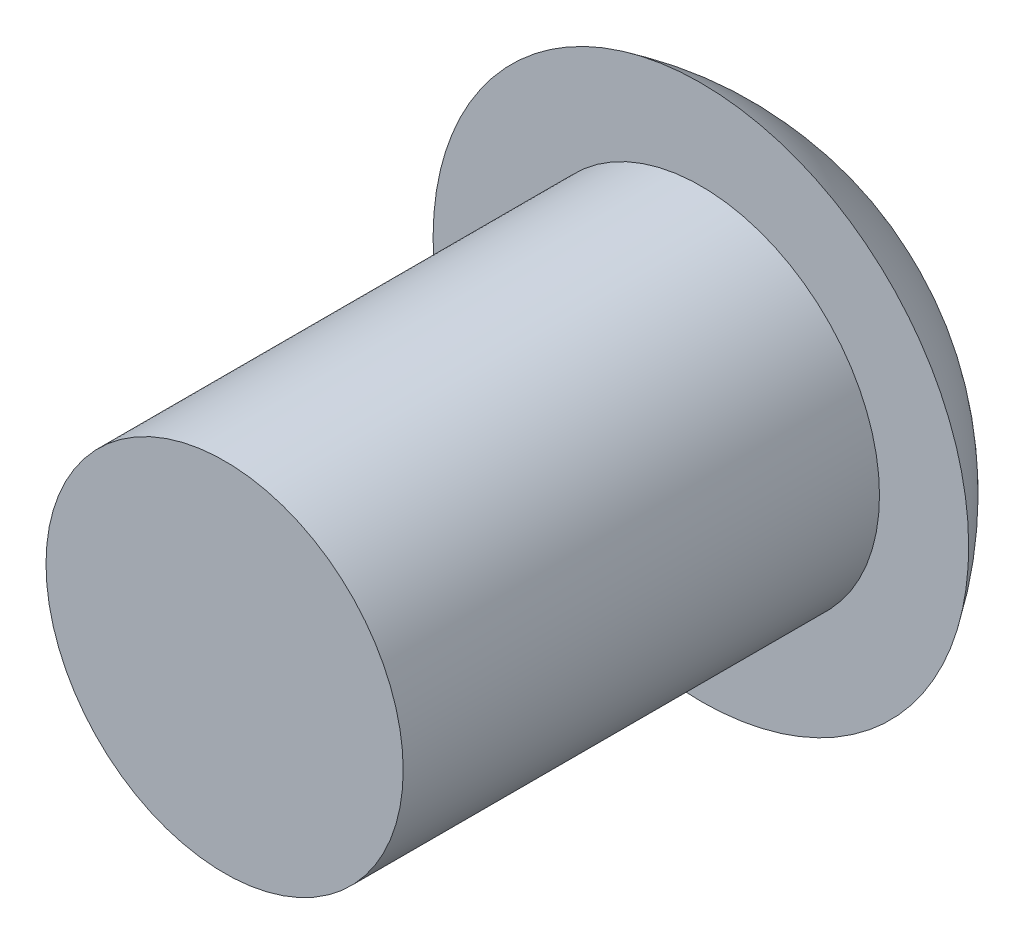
ISO-10303-21;
HEADER;
FILE_DESCRIPTION(('STEP AP214'),'2;1');
FILE_NAME('part.step','',(''),(''),'','','');
FILE_SCHEMA(('AUTOMOTIVE_DESIGN { 1 0 10303 214 1 1 1 1 }'));
ENDSEC;
DATA;
#1=APPLICATION_CONTEXT('core data for automotive mechanical design processes');
#2=APPLICATION_PROTOCOL_DEFINITION('international standard','automotive_design',2000,#1);
#3=PRODUCT_CONTEXT('',#1,'mechanical');
#4=PRODUCT('Part','Part','',(#3));
#5=PRODUCT_RELATED_PRODUCT_CATEGORY('part','',(#4));
#6=PRODUCT_DEFINITION_FORMATION('','',#4);
#7=PRODUCT_DEFINITION_CONTEXT('part definition',#1,'design');
#8=PRODUCT_DEFINITION('design','',#6,#7);
#9=PRODUCT_DEFINITION_SHAPE('','',#8);
#10=(LENGTH_UNIT() NAMED_UNIT(*) SI_UNIT(.MILLI.,.METRE.));
#11=(NAMED_UNIT(*) PLANE_ANGLE_UNIT() SI_UNIT($,.RADIAN.));
#12=(NAMED_UNIT(*) SI_UNIT($,.STERADIAN.) SOLID_ANGLE_UNIT());
#13=UNCERTAINTY_MEASURE_WITH_UNIT(LENGTH_MEASURE(1.E-05),#10,'distance_accuracy_value','');
#14=(GEOMETRIC_REPRESENTATION_CONTEXT(3) GLOBAL_UNCERTAINTY_ASSIGNED_CONTEXT((#13)) GLOBAL_UNIT_ASSIGNED_CONTEXT((#10,
#11,#12)) REPRESENTATION_CONTEXT('',''));
#15=CARTESIAN_POINT('',(0.,0.,0.));
#16=DIRECTION('',(0.,0.,1.));
#17=DIRECTION('',(1.,0.,0.));
#18=AXIS2_PLACEMENT_3D('',#15,#16,#17);
#19=CARTESIAN_POINT('',(-4.064,46.0375,2.44475));
#20=DIRECTION('',(0.,0.,1.));
#21=DIRECTION('',(1.,0.,0.));
#22=AXIS2_PLACEMENT_3D('',#19,#20,#21);
#23=PLANE('',#22);
#24=CARTESIAN_POINT('',(-4.064,46.0375,2.44475));
#25=DIRECTION('',(0.,0.,1.));
#26=DIRECTION('',(1.,0.,0.));
#27=AXIS2_PLACEMENT_3D('',#24,#25,#26);
#28=CIRCLE('',#27,1.190625);
#29=CARTESIAN_POINT('',(-2.873375,46.0375,2.44475));
#30=VERTEX_POINT('',#29);
#31=EDGE_CURVE('E21',#30,#30,#28,.F.);
#32=ORIENTED_EDGE('',*,*,#31,.F.);
#33=EDGE_LOOP('',(#32));
#34=FACE_BOUND('',#33,.T.);
#35=ADVANCED_FACE('F15',(#34),#23,.T.);
#36=CARTESIAN_POINT('',(-4.064,46.0375,-0.73025));
#37=DIRECTION('',(0.,0.,1.));
#38=DIRECTION('',(1.,0.,0.));
#39=AXIS2_PLACEMENT_3D('',#36,#37,#38);
#40=CYLINDRICAL_SURFACE('',#39,1.190625);
#41=CARTESIAN_POINT('',(-4.064,46.0375,-0.73025));
#42=DIRECTION('',(0.,0.,1.));
#43=DIRECTION('',(1.,0.,0.));
#44=AXIS2_PLACEMENT_3D('',#41,#42,#43);
#45=CIRCLE('',#44,1.190625);
#46=CARTESIAN_POINT('',(-2.873375,46.0375,-0.73025));
#47=VERTEX_POINT('',#46);
#48=EDGE_CURVE('E25',#47,#47,#45,.T.);
#49=ORIENTED_EDGE('',*,*,#48,.T.);
#50=EDGE_LOOP('',(#49));
#51=FACE_BOUND('',#50,.T.);
#52=ORIENTED_EDGE('',*,*,#31,.T.);
#53=EDGE_LOOP('',(#52));
#54=FACE_BOUND('',#53,.T.);
#55=ADVANCED_FACE('F37',(#51,#54),#40,.T.);
#56=CARTESIAN_POINT('',(-4.064,44.2522576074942,-0.73025));
#57=DIRECTION('',(0.,0.,-1.));
#58=DIRECTION('',(-1.,0.,0.));
#59=AXIS2_PLACEMENT_3D('',#56,#57,#58);
#60=PLANE('',#59);
#61=CARTESIAN_POINT('',(-5.84924239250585,46.0375,-0.73025));
#62=CARTESIAN_POINT('',(-5.8492431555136,46.0876634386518,-0.73025));
#63=CARTESIAN_POINT('',(-5.84712732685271,46.1378186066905,-0.73025));
#64=CARTESIAN_POINT('',(-5.8386814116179,46.2377784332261,-0.73025));
#65=CARTESIAN_POINT('',(-5.83235116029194,46.2875830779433,-0.73025));
#66=CARTESIAN_POINT('',(-5.81551164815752,46.386522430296,-0.73025));
#67=CARTESIAN_POINT('',(-5.80499917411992,46.4356565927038,-0.73025));
#68=CARTESIAN_POINT('',(-5.77986704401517,46.5328967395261,-0.73025));
#69=CARTESIAN_POINT('',(-5.76524376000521,46.5810017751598,-0.730250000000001));
#70=CARTESIAN_POINT('',(-5.71539590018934,46.7230866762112,-0.730250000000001));
#71=CARTESIAN_POINT('',(-5.67415973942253,46.8150323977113,-0.73025));
#72=CARTESIAN_POINT('',(-5.57681754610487,46.9906826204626,-0.73025));
#73=CARTESIAN_POINT('',(-5.52071123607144,47.0743869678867,-0.730250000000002));
#74=CARTESIAN_POINT('',(-5.42666725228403,47.1919512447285,-0.730250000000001));
#75=CARTESIAN_POINT('',(-5.39364639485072,47.2298299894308,-0.73025));
#76=CARTESIAN_POINT('',(-5.32456807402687,47.3026383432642,-0.73025));
#77=CARTESIAN_POINT('',(-5.28851355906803,47.3375707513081,-0.73025));
#78=CARTESIAN_POINT('',(-5.17609167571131,47.4376393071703,-0.73025));
#79=CARTESIAN_POINT('',(-5.09544241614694,47.4980761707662,-0.73025));
#80=CARTESIAN_POINT('',(-4.92518445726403,47.6045177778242,-0.73025));
#81=CARTESIAN_POINT('',(-4.83557592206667,47.6505227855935,-0.730250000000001));
#82=CARTESIAN_POINT('',(-4.64989627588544,47.726844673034,-0.730249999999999));
#83=CARTESIAN_POINT('',(-4.55382517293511,47.7571615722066,-0.730249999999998));
#84=CARTESIAN_POINT('',(-4.35795955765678,47.8012337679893,-0.730249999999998));
#85=CARTESIAN_POINT('',(-4.25816503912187,47.81498903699,-0.730249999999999));
#86=CARTESIAN_POINT('',(-4.05768254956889,47.825550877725,-0.730250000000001));
#87=CARTESIAN_POINT('',(-3.95699458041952,47.8223574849,-0.73025));
#88=CARTESIAN_POINT('',(-3.75758404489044,47.799111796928,-0.730250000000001));
#89=CARTESIAN_POINT('',(-3.65886147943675,47.7790594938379,-0.730250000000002));
#90=CARTESIAN_POINT('',(-3.46618389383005,47.7226654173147,-0.730249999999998));
#91=CARTESIAN_POINT('',(-3.37222887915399,47.6863236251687,-0.730249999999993));
#92=CARTESIAN_POINT('',(-3.19175372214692,47.5983821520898,-0.730250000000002));
#93=CARTESIAN_POINT('',(-3.10523357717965,47.546782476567,-0.730250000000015));
#94=CARTESIAN_POINT('',(-2.94208419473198,47.4297900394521,-0.730249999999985));
#95=CARTESIAN_POINT('',(-2.86545495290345,47.3643972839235,-0.730249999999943));
#96=CARTESIAN_POINT('',(-2.72426260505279,47.2216749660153,-0.730249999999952));
#97=CARTESIAN_POINT('',(-2.65969950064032,47.1443454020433,-0.730250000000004));
#98=CARTESIAN_POINT('',(-2.54447218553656,46.979944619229,-0.730249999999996));
#99=CARTESIAN_POINT('',(-2.49380797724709,46.8928733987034,-0.730249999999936));
#100=CARTESIAN_POINT('',(-2.40781667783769,46.7114610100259,-0.730249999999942));
#101=CARTESIAN_POINT('',(-2.37248958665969,46.6171198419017,-0.730250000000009));
#102=CARTESIAN_POINT('',(-2.31817535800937,46.4238456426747,-0.730249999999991));
#103=CARTESIAN_POINT('',(-2.29918821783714,46.3249126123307,-0.730249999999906));
#104=CARTESIAN_POINT('',(-2.27809287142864,46.1252631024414,-0.730249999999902));
#105=CARTESIAN_POINT('',(-2.27598466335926,46.0245466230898,-0.730249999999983));
#106=CARTESIAN_POINT('',(-2.28870702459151,45.8241892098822,-0.730250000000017));
#107=CARTESIAN_POINT('',(-2.30353760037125,45.7245482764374,-0.730249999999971));
#108=CARTESIAN_POINT('',(-2.34971654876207,45.5291704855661,-0.730249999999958));
#109=CARTESIAN_POINT('',(-2.38106492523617,45.4334336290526,-0.73024999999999));
#110=CARTESIAN_POINT('',(-2.4593895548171,45.2485817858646,-0.73025000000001));
#111=CARTESIAN_POINT('',(-2.50636579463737,45.1594667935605,-0.730249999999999));
#112=CARTESIAN_POINT('',(-2.61461264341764,44.9903882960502,-0.730249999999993));
#113=CARTESIAN_POINT('',(-2.67588325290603,44.9104247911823,-0.730249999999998));
#114=CARTESIAN_POINT('',(-2.81097960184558,44.7619191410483,-0.730250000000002));
#115=CARTESIAN_POINT('',(-2.88480535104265,44.6933770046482,-0.73025));
#116=CARTESIAN_POINT('',(-3.04291596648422,44.5696601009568,-0.730249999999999));
#117=CARTESIAN_POINT('',(-3.1272007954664,44.5144852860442,-0.73025));
#118=CARTESIAN_POINT('',(-3.30383775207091,44.4190686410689,-0.73025));
#119=CARTESIAN_POINT('',(-3.39618993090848,44.3788269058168,-0.73025));
#120=CARTESIAN_POINT('',(-3.58634186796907,44.314418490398,-0.730249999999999));
#121=CARTESIAN_POINT('',(-3.68414176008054,44.2902522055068,-0.73025));
#122=CARTESIAN_POINT('',(-3.88240507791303,44.258683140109,-0.73025));
#123=CARTESIAN_POINT('',(-3.98286835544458,44.2512794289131,-0.73025));
#124=CARTESIAN_POINT('',(-4.1835996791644,44.2534430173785,-0.73025));
#125=CARTESIAN_POINT('',(-4.28386774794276,44.2630082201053,-0.73025));
#126=CARTESIAN_POINT('',(-4.48140499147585,44.298838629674,-0.73025));
#127=CARTESIAN_POINT('',(-4.57867324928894,44.3251088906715,-0.730249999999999));
#128=CARTESIAN_POINT('',(-4.76746959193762,44.3936298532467,-0.730249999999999));
#129=CARTESIAN_POINT('',(-4.8589946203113,44.4358889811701,-0.73025));
#130=CARTESIAN_POINT('',(-5.0335185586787,44.5351047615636,-0.73025));
#131=CARTESIAN_POINT('',(-5.11652887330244,44.5920413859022,-0.730250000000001));
#132=CARTESIAN_POINT('',(-5.27078802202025,44.718207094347,-0.73025));
#133=CARTESIAN_POINT('',(-5.34218168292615,44.7872581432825,-0.730249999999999));
#134=CARTESIAN_POINT('',(-5.43989470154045,44.898878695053,-0.730249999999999));
#135=CARTESIAN_POINT('',(-5.47090695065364,44.9374329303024,-0.73025));
#136=CARTESIAN_POINT('',(-5.5296621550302,45.0170227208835,-0.73025));
#137=CARTESIAN_POINT('',(-5.55740148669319,45.0580609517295,-0.730249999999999));
#138=CARTESIAN_POINT('',(-5.63605731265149,45.1855761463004,-0.730249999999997));
#139=CARTESIAN_POINT('',(-5.68155661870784,45.2754773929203,-0.730249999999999));
#140=CARTESIAN_POINT('',(-5.75680321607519,45.4616588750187,-0.730250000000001));
#141=CARTESIAN_POINT('',(-5.78654670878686,45.5579406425,-0.730250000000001));
#142=CARTESIAN_POINT('',(-5.8216997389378,45.7185930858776,-0.73025));
#143=CARTESIAN_POINT('',(-5.8320180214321,45.7819310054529,-0.73025));
#144=CARTESIAN_POINT('',(-5.84578785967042,45.9093505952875,-0.73025));
#145=CARTESIAN_POINT('',(-5.84924141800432,45.9734320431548,-0.73025));
#146=CARTESIAN_POINT('',(-5.84924239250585,46.0375,-0.73025));
#147=B_SPLINE_CURVE_WITH_KNOTS('',3,(#61,#62,#63,#64,#65,#66,#67,#68,#69,#70,#71,#72,#73,#74,
#75,#76,#77,#78,#79,#80,#81,#82,#83,#84,#85,#86,#87,#88,#89,#90,#91,#92,#93,#94,#95,#96,#97,#98,
#99,#100,#101,#102,#103,#104,#105,#106,#107,#108,#109,#110,#111,#112,#113,#114,#115,#116,#117,
#118,#119,#120,#121,#122,#123,#124,#125,#126,#127,#128,#129,#130,#131,#132,#133,#134,#135,#136,
#137,#138,#139,#140,#141,#142,#143,#144,#145,#146),.UNSPECIFIED.,.T.,.F.,(4,2,2,2,2,2,2,2,2,2,2,
2,2,2,2,2,2,2,2,2,2,2,2,2,2,2,2,2,2,2,2,2,2,2,2,2,2,2,2,2,2,2,4),(0.,0.150431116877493,
0.300868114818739,0.451420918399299,0.602107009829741,0.902890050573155,1.20367870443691,
1.3542749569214,1.50472649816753,1.80551804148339,2.10630407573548,2.40708973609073,
2.70787589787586,3.00866143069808,3.30944710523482,3.61023312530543,3.91101903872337,
4.21180481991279,4.51259064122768,4.81337651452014,5.11416238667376,5.41494820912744,
5.71573399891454,6.01651990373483,6.31730587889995,6.6180915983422,6.91887732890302,
7.21966329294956,7.52044818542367,7.82123498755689,8.12202918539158,8.42280668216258,
8.72354701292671,9.0243783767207,9.32536850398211,9.62595007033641,9.92243663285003,
10.0707267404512,10.2191795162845,10.5199291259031,10.8207512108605,11.0129355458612,
11.2050638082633),.UNSPECIFIED.);
#148=CARTESIAN_POINT('',(-5.84924239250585,46.0375,-0.73025));
#149=VERTEX_POINT('',#148);
#150=EDGE_CURVE('E10',#149,#149,#147,.T.);
#151=ORIENTED_EDGE('',*,*,#150,.F.);
#152=EDGE_LOOP('',(#151));
#153=FACE_BOUND('',#152,.T.);
#154=ORIENTED_EDGE('',*,*,#48,.F.);
#155=EDGE_LOOP('',(#154));
#156=FACE_BOUND('',#155,.T.);
#157=ADVANCED_FACE('F33',(#153,#156),#60,.F.);
#158=CARTESIAN_POINT('',(-4.064,46.0375,0.43815));
#159=DIRECTION('',(0.724564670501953,0.491888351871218,0.482754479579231));
#160=DIRECTION('',(-0.435381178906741,0.869663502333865,-0.232655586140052));
#161=AXIS2_PLACEMENT_3D('',#158,#159,#160);
#162=SPHERICAL_SURFACE('',#161,2.1336);
#163=ORIENTED_EDGE('',*,*,#150,.T.);
#164=EDGE_LOOP('',(#163));
#165=FACE_BOUND('',#164,.T.);
#166=ADVANCED_FACE('F17',(#165),#162,.T.);
#167=CLOSED_SHELL('',(#35,#55,#157,#166));
#168=MANIFOLD_SOLID_BREP('B1',#167);
#169=ADVANCED_BREP_SHAPE_REPRESENTATION('',(#18,#168),#14);
#170=SHAPE_DEFINITION_REPRESENTATION(#9,#169);
ENDSEC;
END-ISO-10303-21;
